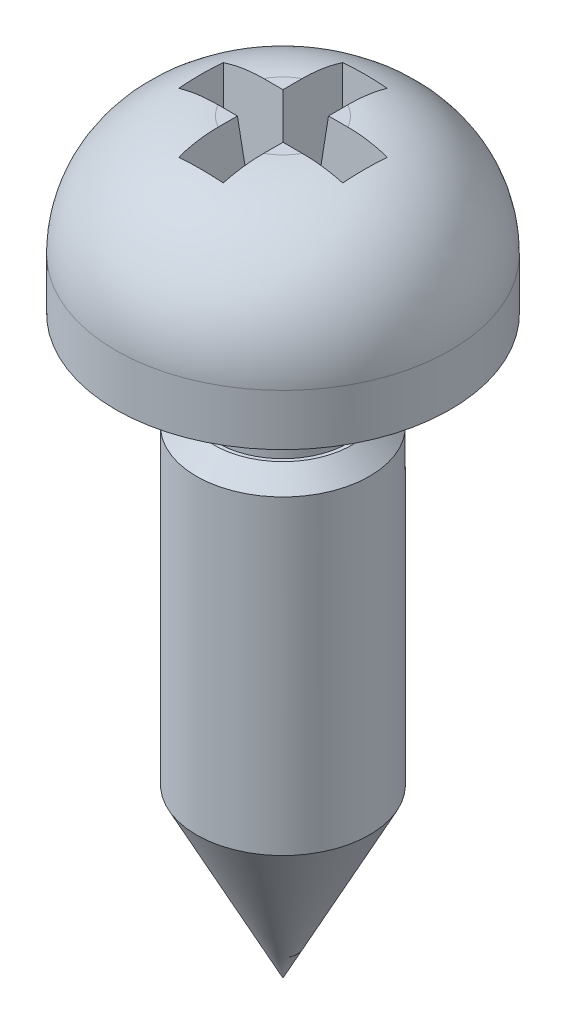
ISO-10303-21;
HEADER;
FILE_DESCRIPTION(('STEP AP214'),'2;1');
FILE_NAME('part.step','',(''),(''),'','','');
FILE_SCHEMA(('AUTOMOTIVE_DESIGN { 1 0 10303 214 1 1 1 1 }'));
ENDSEC;
DATA;
#1=APPLICATION_CONTEXT('core data for automotive mechanical design processes');
#2=APPLICATION_PROTOCOL_DEFINITION('international standard','automotive_design',2000,#1);
#3=PRODUCT_CONTEXT('',#1,'mechanical');
#4=PRODUCT('Part','Part','',(#3));
#5=PRODUCT_RELATED_PRODUCT_CATEGORY('part','',(#4));
#6=PRODUCT_DEFINITION_FORMATION('','',#4);
#7=PRODUCT_DEFINITION_CONTEXT('part definition',#1,'design');
#8=PRODUCT_DEFINITION('design','',#6,#7);
#9=PRODUCT_DEFINITION_SHAPE('','',#8);
#10=(LENGTH_UNIT() NAMED_UNIT(*) SI_UNIT(.MILLI.,.METRE.));
#11=(NAMED_UNIT(*) PLANE_ANGLE_UNIT() SI_UNIT($,.RADIAN.));
#12=(NAMED_UNIT(*) SI_UNIT($,.STERADIAN.) SOLID_ANGLE_UNIT());
#13=UNCERTAINTY_MEASURE_WITH_UNIT(LENGTH_MEASURE(1.E-05),#10,'distance_accuracy_value','');
#14=(GEOMETRIC_REPRESENTATION_CONTEXT(3) GLOBAL_UNCERTAINTY_ASSIGNED_CONTEXT((#13)) GLOBAL_UNIT_ASSIGNED_CONTEXT((#10,
#11,#12)) REPRESENTATION_CONTEXT('',''));
#15=CARTESIAN_POINT('',(0.,0.,0.));
#16=DIRECTION('',(0.,0.,1.));
#17=DIRECTION('',(1.,0.,0.));
#18=AXIS2_PLACEMENT_3D('',#15,#16,#17);
#19=CARTESIAN_POINT('',(0.,-3.44823964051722,0.));
#20=DIRECTION('',(0.,-1.,0.));
#21=DIRECTION('',(0.,0.,-1.));
#22=AXIS2_PLACEMENT_3D('',#19,#20,#21);
#23=PLANE('',#22);
#24=DIRECTION('',(-1.,0.,0.));
#25=VECTOR('',#24,1.);
#26=CARTESIAN_POINT('',(-0.25,-3.44823964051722,0.381232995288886));
#27=LINE('',#26,#25);
#28=CARTESIAN_POINT('',(-0.703321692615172,-3.44823964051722,0.381232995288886));
#29=VERTEX_POINT('',#28);
#30=CARTESIAN_POINT('',(-0.381232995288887,-3.44823964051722,0.381232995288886));
#31=VERTEX_POINT('',#30);
#32=EDGE_CURVE('E254',#29,#31,#27,.F.);
#33=ORIENTED_EDGE('',*,*,#32,.F.);
#34=CARTESIAN_POINT('',(0.,-3.44823964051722,0.));
#35=DIRECTION('',(0.,-1.,0.));
#36=DIRECTION('',(0.,0.,-1.));
#37=AXIS2_PLACEMENT_3D('',#34,#35,#36);
#38=CIRCLE('',#37,0.800000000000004);
#39=CARTESIAN_POINT('',(-0.381232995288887,-3.44823964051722,0.703321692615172));
#40=VERTEX_POINT('',#39);
#41=EDGE_CURVE('E267',#29,#40,#38,.F.);
#42=ORIENTED_EDGE('',*,*,#41,.T.);
#43=DIRECTION('',(0.,0.,-1.));
#44=VECTOR('',#43,1.);
#45=CARTESIAN_POINT('',(-0.381232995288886,-3.44823964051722,1.25));
#46=LINE('',#45,#44);
#47=EDGE_CURVE('E251',#31,#40,#46,.F.);
#48=ORIENTED_EDGE('',*,*,#47,.F.);
#49=EDGE_LOOP('',(#33,#42,#48));
#50=FACE_BOUND('',#49,.T.);
#51=ADVANCED_FACE('F31',(#50),#23,.F.);
#52=DIRECTION('',(0.,0.,1.));
#53=VECTOR('',#52,1.);
#54=CARTESIAN_POINT('',(0.381232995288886,-3.44823964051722,0.25));
#55=LINE('',#54,#53);
#56=CARTESIAN_POINT('',(0.381232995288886,-3.44823964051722,0.703321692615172));
#57=VERTEX_POINT('',#56);
#58=CARTESIAN_POINT('',(0.381232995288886,-3.44823964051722,0.381232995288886));
#59=VERTEX_POINT('',#58);
#60=EDGE_CURVE('E248',#57,#59,#55,.F.);
#61=ORIENTED_EDGE('',*,*,#60,.F.);
#62=CARTESIAN_POINT('',(0.,-3.44823964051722,0.));
#63=DIRECTION('',(0.,-1.,0.));
#64=DIRECTION('',(0.,0.,-1.));
#65=AXIS2_PLACEMENT_3D('',#62,#63,#64);
#66=CIRCLE('',#65,0.800000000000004);
#67=CARTESIAN_POINT('',(0.703321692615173,-3.44823964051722,0.381232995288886));
#68=VERTEX_POINT('',#67);
#69=EDGE_CURVE('E265',#57,#68,#66,.F.);
#70=ORIENTED_EDGE('',*,*,#69,.T.);
#71=DIRECTION('',(-1.,0.,0.));
#72=VECTOR('',#71,1.);
#73=CARTESIAN_POINT('',(1.25,-3.44823964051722,0.381232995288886));
#74=LINE('',#73,#72);
#75=EDGE_CURVE('E250',#59,#68,#74,.F.);
#76=ORIENTED_EDGE('',*,*,#75,.F.);
#77=EDGE_LOOP('',(#61,#70,#76));
#78=FACE_BOUND('',#77,.T.);
#79=ADVANCED_FACE('F412',(#78),#23,.F.);
#80=DIRECTION('',(1.,0.,0.));
#81=VECTOR('',#80,1.);
#82=CARTESIAN_POINT('',(0.249999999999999,-3.44823964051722,-0.381232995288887));
#83=LINE('',#82,#81);
#84=CARTESIAN_POINT('',(0.703321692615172,-3.44823964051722,-0.381232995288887));
#85=VERTEX_POINT('',#84);
#86=CARTESIAN_POINT('',(0.381232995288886,-3.44823964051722,-0.381232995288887));
#87=VERTEX_POINT('',#86);
#88=EDGE_CURVE('E175',#85,#87,#83,.F.);
#89=ORIENTED_EDGE('',*,*,#88,.F.);
#90=CARTESIAN_POINT('',(0.,-3.44823964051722,0.));
#91=DIRECTION('',(0.,-1.,0.));
#92=DIRECTION('',(0.,0.,-1.));
#93=AXIS2_PLACEMENT_3D('',#90,#91,#92);
#94=CIRCLE('',#93,0.800000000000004);
#95=CARTESIAN_POINT('',(0.381232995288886,-3.44823964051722,-0.703321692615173));
#96=VERTEX_POINT('',#95);
#97=EDGE_CURVE('E263',#85,#96,#94,.F.);
#98=ORIENTED_EDGE('',*,*,#97,.T.);
#99=DIRECTION('',(0.,0.,1.));
#100=VECTOR('',#99,1.);
#101=CARTESIAN_POINT('',(0.381232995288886,-3.44823964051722,-1.25));
#102=LINE('',#101,#100);
#103=EDGE_CURVE('E172',#87,#96,#102,.F.);
#104=ORIENTED_EDGE('',*,*,#103,.F.);
#105=EDGE_LOOP('',(#89,#98,#104));
#106=FACE_BOUND('',#105,.T.);
#107=ADVANCED_FACE('F377',(#106),#23,.F.);
#108=CARTESIAN_POINT('',(0.,-15.9482396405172,0.));
#109=DIRECTION('',(0.,1.,0.));
#110=DIRECTION('',(0.,0.,1.));
#111=AXIS2_PLACEMENT_3D('',#108,#109,#110);
#112=CONICAL_SURFACE('',#111,0.,0.477831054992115);
#113=CARTESIAN_POINT('',(0.,-13.1482396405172,0.));
#114=DIRECTION('',(0.,1.,0.));
#115=DIRECTION('',(0.,0.,1.));
#116=AXIS2_PLACEMENT_3D('',#113,#114,#115);
#117=CIRCLE('',#116,1.45000000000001);
#118=CARTESIAN_POINT('',(0.,-13.1482396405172,1.45000000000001));
#119=VERTEX_POINT('',#118);
#120=EDGE_CURVE('E210',#119,#119,#117,.T.);
#121=ORIENTED_EDGE('',*,*,#120,.F.);
#122=EDGE_LOOP('',(#121));
#123=FACE_BOUND('',#122,.T.);
#124=CARTESIAN_POINT('',(0.,-15.9482396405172,0.));
#125=VERTEX_POINT('',#124);
#126=VERTEX_LOOP('',#125);
#127=FACE_BOUND('',#126,.T.);
#128=ADVANCED_FACE('F373',(#123,#127),#112,.T.);
#129=CARTESIAN_POINT('',(0.,31.7451466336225,0.));
#130=DIRECTION('',(0.,1.,0.));
#131=DIRECTION('',(0.,0.,1.));
#132=AXIS2_PLACEMENT_3D('',#129,#130,#131);
#133=CYLINDRICAL_SURFACE('',#132,1.45000000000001);
#134=CARTESIAN_POINT('',(0.,-7.94823964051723,0.));
#135=DIRECTION('',(0.,-1.,0.));
#136=DIRECTION('',(0.,0.,-1.));
#137=AXIS2_PLACEMENT_3D('',#134,#135,#136);
#138=CIRCLE('',#137,1.45000000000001);
#139=CARTESIAN_POINT('',(0.,-7.94823964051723,-1.45000000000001));
#140=VERTEX_POINT('',#139);
#141=EDGE_CURVE('E216',#140,#140,#138,.T.);
#142=ORIENTED_EDGE('',*,*,#141,.T.);
#143=EDGE_LOOP('',(#142));
#144=FACE_BOUND('',#143,.T.);
#145=ORIENTED_EDGE('',*,*,#120,.T.);
#146=EDGE_LOOP('',(#145));
#147=FACE_BOUND('',#146,.T.);
#148=ADVANCED_FACE('F376',(#144,#147),#133,.T.);
#149=CARTESIAN_POINT('',(1.09,-7.64823964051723,0.));
#150=DIRECTION('',(0.,-1.,0.));
#151=DIRECTION('',(0.,0.,-1.));
#152=AXIS2_PLACEMENT_3D('',#149,#150,#151);
#153=PLANE('',#152);
#154=CARTESIAN_POINT('',(0.,-7.64823964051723,0.));
#155=DIRECTION('',(0.,-1.,0.));
#156=DIRECTION('',(0.,0.,-1.));
#157=AXIS2_PLACEMENT_3D('',#154,#155,#156);
#158=CIRCLE('',#157,1.15);
#159=CARTESIAN_POINT('',(0.,-7.64823964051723,-1.15));
#160=VERTEX_POINT('',#159);
#161=EDGE_CURVE('E213',#160,#160,#158,.F.);
#162=ORIENTED_EDGE('',*,*,#161,.T.);
#163=EDGE_LOOP('',(#162));
#164=FACE_BOUND('',#163,.T.);
#165=CARTESIAN_POINT('',(0.,-7.64823964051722,0.));
#166=DIRECTION('',(0.,1.,0.));
#167=DIRECTION('',(0.,0.,1.));
#168=AXIS2_PLACEMENT_3D('',#165,#166,#167);
#169=CIRCLE('',#168,1.09);
#170=CARTESIAN_POINT('',(0.,-7.64823964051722,1.09));
#171=VERTEX_POINT('',#170);
#172=EDGE_CURVE('E206',#171,#171,#169,.T.);
#173=ORIENTED_EDGE('',*,*,#172,.F.);
#174=EDGE_LOOP('',(#173));
#175=FACE_BOUND('',#174,.T.);
#176=ADVANCED_FACE('F381',(#164,#175),#153,.F.);
#177=CARTESIAN_POINT('',(0.,31.7451466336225,0.));
#178=DIRECTION('',(0.,1.,0.));
#179=DIRECTION('',(0.,0.,1.));
#180=AXIS2_PLACEMENT_3D('',#177,#178,#179);
#181=CYLINDRICAL_SURFACE('',#180,1.09);
#182=CARTESIAN_POINT('',(0.,-6.557547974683,0.));
#183=DIRECTION('',(0.,1.,0.));
#184=DIRECTION('',(0.,0.,1.));
#185=AXIS2_PLACEMENT_3D('',#182,#183,#184);
#186=CIRCLE('',#185,1.09);
#187=CARTESIAN_POINT('',(0.,-6.557547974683,1.09));
#188=VERTEX_POINT('',#187);
#189=EDGE_CURVE('E11',#188,#188,#186,.F.);
#190=ORIENTED_EDGE('',*,*,#189,.T.);
#191=EDGE_LOOP('',(#190));
#192=FACE_BOUND('',#191,.T.);
#193=ORIENTED_EDGE('',*,*,#172,.T.);
#194=EDGE_LOOP('',(#193));
#195=FACE_BOUND('',#194,.T.);
#196=ADVANCED_FACE('F385',(#192,#195),#181,.T.);
#197=CARTESIAN_POINT('',(1.09,-6.307547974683,0.));
#198=DIRECTION('',(0.,1.,0.));
#199=DIRECTION('',(0.,0.,1.));
#200=AXIS2_PLACEMENT_3D('',#197,#198,#199);
#201=PLANE('',#200);
#202=CARTESIAN_POINT('',(0.,-6.307547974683,0.));
#203=DIRECTION('',(0.,1.,0.));
#204=DIRECTION('',(0.,0.,1.));
#205=AXIS2_PLACEMENT_3D('',#202,#203,#204);
#206=CIRCLE('',#205,1.34);
#207=CARTESIAN_POINT('',(0.,-6.307547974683,1.34));
#208=VERTEX_POINT('',#207);
#209=EDGE_CURVE('E40',#208,#208,#206,.T.);
#210=ORIENTED_EDGE('',*,*,#209,.T.);
#211=EDGE_LOOP('',(#210));
#212=FACE_BOUND('',#211,.T.);
#213=CARTESIAN_POINT('',(0.,-6.307547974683,0.));
#214=DIRECTION('',(0.,1.,0.));
#215=DIRECTION('',(0.,0.,1.));
#216=AXIS2_PLACEMENT_3D('',#213,#214,#215);
#217=CIRCLE('',#216,2.8);
#218=CARTESIAN_POINT('',(0.,-6.307547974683,2.8));
#219=VERTEX_POINT('',#218);
#220=EDGE_CURVE('E203',#219,#219,#217,.T.);
#221=ORIENTED_EDGE('',*,*,#220,.F.);
#222=EDGE_LOOP('',(#221));
#223=FACE_BOUND('',#222,.T.);
#224=ADVANCED_FACE('F389',(#212,#223),#201,.F.);
#225=CARTESIAN_POINT('',(0.,31.7451466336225,0.));
#226=DIRECTION('',(0.,1.,0.));
#227=DIRECTION('',(0.,0.,1.));
#228=AXIS2_PLACEMENT_3D('',#225,#226,#227);
#229=CYLINDRICAL_SURFACE('',#228,2.8);
#230=CARTESIAN_POINT('',(0.,-5.44823964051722,0.));
#231=DIRECTION('',(0.,-1.,0.));
#232=DIRECTION('',(0.,0.,-1.));
#233=AXIS2_PLACEMENT_3D('',#230,#231,#232);
#234=CIRCLE('',#233,2.8);
#235=CARTESIAN_POINT('',(0.,-5.44823964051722,-2.8));
#236=VERTEX_POINT('',#235);
#237=EDGE_CURVE('E332',#236,#236,#234,.T.);
#238=ORIENTED_EDGE('',*,*,#237,.T.);
#239=EDGE_LOOP('',(#238));
#240=FACE_BOUND('',#239,.T.);
#241=ORIENTED_EDGE('',*,*,#220,.T.);
#242=EDGE_LOOP('',(#241));
#243=FACE_BOUND('',#242,.T.);
#244=ADVANCED_FACE('F393',(#240,#243),#229,.T.);
#245=DIRECTION('',(0.,0.,-1.));
#246=VECTOR('',#245,1.);
#247=CARTESIAN_POINT('',(-0.381232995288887,-3.44823964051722,-0.250000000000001));
#248=LINE('',#247,#246);
#249=CARTESIAN_POINT('',(-0.381232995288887,-3.44823964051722,-0.703321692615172));
#250=VERTEX_POINT('',#249);
#251=CARTESIAN_POINT('',(-0.381232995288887,-3.44823964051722,-0.381232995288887));
#252=VERTEX_POINT('',#251);
#253=EDGE_CURVE('E157',#250,#252,#248,.F.);
#254=ORIENTED_EDGE('',*,*,#253,.F.);
#255=CARTESIAN_POINT('',(0.,-3.44823964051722,0.));
#256=DIRECTION('',(0.,-1.,0.));
#257=DIRECTION('',(0.,0.,-1.));
#258=AXIS2_PLACEMENT_3D('',#255,#256,#257);
#259=CIRCLE('',#258,0.800000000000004);
#260=CARTESIAN_POINT('',(-0.703321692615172,-3.44823964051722,-0.381232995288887));
#261=VERTEX_POINT('',#260);
#262=EDGE_CURVE('E219',#250,#261,#259,.F.);
#263=ORIENTED_EDGE('',*,*,#262,.T.);
#264=DIRECTION('',(1.,0.,0.));
#265=VECTOR('',#264,1.);
#266=CARTESIAN_POINT('',(-1.25,-3.44823964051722,-0.381232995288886));
#267=LINE('',#266,#265);
#268=EDGE_CURVE('E256',#252,#261,#267,.F.);
#269=ORIENTED_EDGE('',*,*,#268,.F.);
#270=EDGE_LOOP('',(#254,#263,#269));
#271=FACE_BOUND('',#270,.T.);
#272=ADVANCED_FACE('F397',(#271),#23,.F.);
#273=CARTESIAN_POINT('',(0.,-7.64823964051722,0.));
#274=DIRECTION('',(0.,-1.,0.));
#275=DIRECTION('',(0.,0.,-1.));
#276=AXIS2_PLACEMENT_3D('',#273,#274,#275);
#277=CONICAL_SURFACE('',#276,1.15,0.785398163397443);
#278=ORIENTED_EDGE('',*,*,#141,.F.);
#279=EDGE_LOOP('',(#278));
#280=FACE_BOUND('',#279,.T.);
#281=ORIENTED_EDGE('',*,*,#161,.F.);
#282=EDGE_LOOP('',(#281));
#283=FACE_BOUND('',#282,.T.);
#284=ADVANCED_FACE('F302',(#280,#283),#277,.T.);
#285=CARTESIAN_POINT('',(-0.25,-4.94823964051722,-0.250000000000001));
#286=DIRECTION('',(0.996194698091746,0.0871557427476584,0.));
#287=DIRECTION('',(-0.0871557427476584,0.996194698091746,0.));
#288=AXIS2_PLACEMENT_3D('',#285,#286,#287);
#289=PLANE('',#288);
#290=DIRECTION('',(-0.0868265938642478,0.992432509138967,-0.0868265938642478));
#291=VECTOR('',#290,1.);
#292=CARTESIAN_POINT('',(-0.250000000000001,-4.94823964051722,-1.25));
#293=LINE('',#292,#291);
#294=CARTESIAN_POINT('',(-0.250000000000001,-4.94823964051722,-1.25));
#295=VERTEX_POINT('',#294);
#296=CARTESIAN_POINT('',(-0.372549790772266,-3.54748912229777,-1.37254979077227));
#297=VERTEX_POINT('',#296);
#298=EDGE_CURVE('E207',#295,#297,#293,.T.);
#299=ORIENTED_EDGE('',*,*,#298,.T.);
#300=CARTESIAN_POINT('',(-0.372549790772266,-3.54748912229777,-1.37254979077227));
#301=CARTESIAN_POINT('',(-0.374036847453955,-3.53049198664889,-1.31838121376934));
#302=CARTESIAN_POINT('',(-0.375329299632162,-3.51571919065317,-1.26351872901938));
#303=CARTESIAN_POINT('',(-0.3775219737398,-3.49065681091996,-1.15310878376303));
#304=CARTESIAN_POINT('',(-0.378424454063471,-3.48034141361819,-1.09756723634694));
#305=CARTESIAN_POINT('',(-0.37985118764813,-3.46403377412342,-0.985883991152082));
#306=CARTESIAN_POINT('',(-0.380375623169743,-3.45803944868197,-0.929742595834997));
#307=CARTESIAN_POINT('',(-0.381069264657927,-3.45011109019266,-0.816835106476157));
#308=CARTESIAN_POINT('',(-0.381236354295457,-3.44820124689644,-0.760067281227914));
#309=CARTESIAN_POINT('',(-0.381232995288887,-3.44823964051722,-0.703321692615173));
#310=B_SPLINE_CURVE_WITH_KNOTS('',3,(#300,#301,#302,#303,#304,#305,#306,#307,#308,#309),
.UNSPECIFIED.,.F.,.F.,(4,2,2,2,4),(0.,0.170316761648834,0.339633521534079,0.508868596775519,
0.679103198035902),.UNSPECIFIED.);
#311=EDGE_CURVE('E306',#297,#250,#310,.T.);
#312=ORIENTED_EDGE('',*,*,#311,.T.);
#313=ORIENTED_EDGE('',*,*,#253,.T.);
#314=DIRECTION('',(-0.0868265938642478,0.992432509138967,-0.0868265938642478));
#315=VECTOR('',#314,1.);
#316=CARTESIAN_POINT('',(-0.257538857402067,-4.86207010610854,-0.257538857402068));
#317=LINE('',#316,#315);
#318=CARTESIAN_POINT('',(-0.25,-4.94823964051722,-0.250000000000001));
#319=VERTEX_POINT('',#318);
#320=EDGE_CURVE('E149',#319,#252,#317,.T.);
#321=ORIENTED_EDGE('',*,*,#320,.F.);
#322=DIRECTION('',(0.,0.,1.));
#323=VECTOR('',#322,1.);
#324=CARTESIAN_POINT('',(-0.25,-4.94823964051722,-0.250000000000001));
#325=LINE('',#324,#323);
#326=EDGE_CURVE('E154',#295,#319,#325,.T.);
#327=ORIENTED_EDGE('',*,*,#326,.F.);
#328=EDGE_LOOP('',(#299,#312,#313,#321,#327));
#329=FACE_BOUND('',#328,.T.);
#330=ADVANCED_FACE('F152',(#329),#289,.T.);
#331=CARTESIAN_POINT('',(-0.250000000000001,-4.94823964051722,-1.25));
#332=DIRECTION('',(0.,0.0871557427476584,0.996194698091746));
#333=DIRECTION('',(0.,-0.996194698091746,0.0871557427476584));
#334=AXIS2_PLACEMENT_3D('',#331,#332,#333);
#335=PLANE('',#334);
#336=DIRECTION('',(0.0868265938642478,0.992432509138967,-0.0868265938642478));
#337=VECTOR('',#336,1.);
#338=CARTESIAN_POINT('',(0.249999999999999,-4.94823964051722,-1.25));
#339=LINE('',#338,#337);
#340=CARTESIAN_POINT('',(0.249999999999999,-4.94823964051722,-1.25));
#341=VERTEX_POINT('',#340);
#342=CARTESIAN_POINT('',(0.372549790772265,-3.54748912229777,-1.37254979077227));
#343=VERTEX_POINT('',#342);
#344=EDGE_CURVE('E237',#341,#343,#339,.T.);
#345=ORIENTED_EDGE('',*,*,#344,.T.);
#346=CARTESIAN_POINT('',(0.372549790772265,-3.54748912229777,-1.37254979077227));
#347=CARTESIAN_POINT('',(0.310547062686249,-3.54234343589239,-1.3729999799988));
#348=CARTESIAN_POINT('',(0.248438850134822,-3.5385543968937,-1.37333147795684));
#349=CARTESIAN_POINT('',(0.124220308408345,-3.53355534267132,-1.37376883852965));
#350=CARTESIAN_POINT('',(0.0621101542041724,-3.53234105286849,-1.37387507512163));
#351=CARTESIAN_POINT('',(-0.0621101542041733,-3.53234105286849,-1.37387507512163));
#352=CARTESIAN_POINT('',(-0.124220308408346,-3.53355534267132,-1.37376883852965));
#353=CARTESIAN_POINT('',(-0.248438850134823,-3.5385543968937,-1.37333147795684));
#354=CARTESIAN_POINT('',(-0.31054706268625,-3.54234343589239,-1.3729999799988));
#355=CARTESIAN_POINT('',(-0.372549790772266,-3.54748912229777,-1.37254979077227));
#356=B_SPLINE_CURVE_WITH_KNOTS('',3,(#346,#347,#348,#349,#350,#351,#352,#353,#354,#355),
.UNSPECIFIED.,.F.,.F.,(4,2,2,2,4),(0.,0.186625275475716,0.372940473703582,0.559255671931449,
0.745880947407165),.UNSPECIFIED.);
#357=EDGE_CURVE('E312',#343,#297,#356,.T.);
#358=ORIENTED_EDGE('',*,*,#357,.T.);
#359=ORIENTED_EDGE('',*,*,#298,.F.);
#360=DIRECTION('',(-1.,0.,0.));
#361=VECTOR('',#360,1.);
#362=CARTESIAN_POINT('',(-0.250000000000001,-4.94823964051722,-1.25));
#363=LINE('',#362,#361);
#364=EDGE_CURVE('E160',#341,#295,#363,.T.);
#365=ORIENTED_EDGE('',*,*,#364,.F.);
#366=EDGE_LOOP('',(#345,#358,#359,#365));
#367=FACE_BOUND('',#366,.T.);
#368=ADVANCED_FACE('F301',(#367),#335,.T.);
#369=CARTESIAN_POINT('',(0.249999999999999,-4.94823964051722,-1.25));
#370=DIRECTION('',(-0.996194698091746,0.0871557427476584,0.));
#371=DIRECTION('',(-0.0871557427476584,-0.996194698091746,0.));
#372=AXIS2_PLACEMENT_3D('',#369,#370,#371);
#373=PLANE('',#372);
#374=ORIENTED_EDGE('',*,*,#103,.T.);
#375=CARTESIAN_POINT('',(0.381232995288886,-3.44823964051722,-0.703321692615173));
#376=CARTESIAN_POINT('',(0.381236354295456,-3.44820124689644,-0.760067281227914));
#377=CARTESIAN_POINT('',(0.381069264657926,-3.45011109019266,-0.816835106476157));
#378=CARTESIAN_POINT('',(0.380375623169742,-3.45803944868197,-0.929742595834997));
#379=CARTESIAN_POINT('',(0.379851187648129,-3.46403377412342,-0.985883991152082));
#380=CARTESIAN_POINT('',(0.37842445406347,-3.48034141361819,-1.09756723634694));
#381=CARTESIAN_POINT('',(0.377521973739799,-3.49065681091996,-1.15310878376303));
#382=CARTESIAN_POINT('',(0.375329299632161,-3.51571919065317,-1.26351872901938));
#383=CARTESIAN_POINT('',(0.374036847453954,-3.53049198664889,-1.31838121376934));
#384=CARTESIAN_POINT('',(0.372549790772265,-3.54748912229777,-1.37254979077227));
#385=B_SPLINE_CURVE_WITH_KNOTS('',3,(#375,#376,#377,#378,#379,#380,#381,#382,#383,#384),
.UNSPECIFIED.,.F.,.F.,(4,2,2,2,4),(0.,0.170234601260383,0.339469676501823,0.508786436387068,
0.679103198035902),.UNSPECIFIED.);
#386=EDGE_CURVE('E435',#96,#343,#385,.T.);
#387=ORIENTED_EDGE('',*,*,#386,.T.);
#388=ORIENTED_EDGE('',*,*,#344,.F.);
#389=DIRECTION('',(0.,0.,-1.));
#390=VECTOR('',#389,1.);
#391=CARTESIAN_POINT('',(0.249999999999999,-4.94823964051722,-1.25));
#392=LINE('',#391,#390);
#393=CARTESIAN_POINT('',(0.249999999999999,-4.94823964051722,-0.250000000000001));
#394=VERTEX_POINT('',#393);
#395=EDGE_CURVE('E200',#394,#341,#392,.T.);
#396=ORIENTED_EDGE('',*,*,#395,.F.);
#397=DIRECTION('',(0.0868265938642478,0.992432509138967,-0.0868265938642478));
#398=VECTOR('',#397,1.);
#399=CARTESIAN_POINT('',(0.257538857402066,-4.86207010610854,-0.257538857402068));
#400=LINE('',#399,#398);
#401=EDGE_CURVE('E240',#394,#87,#400,.T.);
#402=ORIENTED_EDGE('',*,*,#401,.T.);
#403=EDGE_LOOP('',(#374,#387,#388,#396,#402));
#404=FACE_BOUND('',#403,.T.);
#405=ADVANCED_FACE('F295',(#404),#373,.T.);
#406=CARTESIAN_POINT('',(0.249999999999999,-4.94823964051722,-0.250000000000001));
#407=DIRECTION('',(0.,0.0871557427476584,0.996194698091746));
#408=DIRECTION('',(0.,-0.996194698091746,0.0871557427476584));
#409=AXIS2_PLACEMENT_3D('',#406,#407,#408);
#410=PLANE('',#409);
#411=DIRECTION('',(0.0868265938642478,0.992432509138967,-0.0868265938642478));
#412=VECTOR('',#411,1.);
#413=CARTESIAN_POINT('',(1.25,-4.94823964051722,-0.250000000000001));
#414=LINE('',#413,#412);
#415=CARTESIAN_POINT('',(1.25,-4.94823964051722,-0.250000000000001));
#416=VERTEX_POINT('',#415);
#417=CARTESIAN_POINT('',(1.37254979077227,-3.54748912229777,-0.372549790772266));
#418=VERTEX_POINT('',#417);
#419=EDGE_CURVE('E243',#416,#418,#414,.T.);
#420=ORIENTED_EDGE('',*,*,#419,.T.);
#421=CARTESIAN_POINT('',(1.37254979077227,-3.54748912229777,-0.372549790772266));
#422=CARTESIAN_POINT('',(1.31838121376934,-3.53049198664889,-0.374036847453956));
#423=CARTESIAN_POINT('',(1.26351872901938,-3.51571919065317,-0.375329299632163));
#424=CARTESIAN_POINT('',(1.15310878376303,-3.49065681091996,-0.3775219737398));
#425=CARTESIAN_POINT('',(1.09756723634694,-3.48034141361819,-0.378424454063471));
#426=CARTESIAN_POINT('',(0.985883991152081,-3.46403377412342,-0.379851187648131));
#427=CARTESIAN_POINT('',(0.929742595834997,-3.45803944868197,-0.380375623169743));
#428=CARTESIAN_POINT('',(0.816835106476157,-3.45011109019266,-0.381069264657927));
#429=CARTESIAN_POINT('',(0.760067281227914,-3.44820124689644,-0.381236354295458));
#430=CARTESIAN_POINT('',(0.703321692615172,-3.44823964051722,-0.381232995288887));
#431=B_SPLINE_CURVE_WITH_KNOTS('',3,(#421,#422,#423,#424,#425,#426,#427,#428,#429,#430),
.UNSPECIFIED.,.F.,.F.,(4,2,2,2,4),(0.,0.170316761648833,0.339633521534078,0.508868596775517,
0.6791031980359),.UNSPECIFIED.);
#432=EDGE_CURVE('E361',#418,#85,#431,.T.);
#433=ORIENTED_EDGE('',*,*,#432,.T.);
#434=ORIENTED_EDGE('',*,*,#88,.T.);
#435=ORIENTED_EDGE('',*,*,#401,.F.);
#436=DIRECTION('',(-1.,0.,0.));
#437=VECTOR('',#436,1.);
#438=CARTESIAN_POINT('',(0.249999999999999,-4.94823964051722,-0.250000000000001));
#439=LINE('',#438,#437);
#440=EDGE_CURVE('E197',#416,#394,#439,.T.);
#441=ORIENTED_EDGE('',*,*,#440,.F.);
#442=EDGE_LOOP('',(#420,#433,#434,#435,#441));
#443=FACE_BOUND('',#442,.T.);
#444=ADVANCED_FACE('F367',(#443),#410,.T.);
#445=CARTESIAN_POINT('',(1.25,-4.94823964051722,-0.250000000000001));
#446=DIRECTION('',(-0.996194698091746,0.0871557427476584,0.));
#447=DIRECTION('',(-0.0871557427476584,-0.996194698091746,0.));
#448=AXIS2_PLACEMENT_3D('',#445,#446,#447);
#449=PLANE('',#448);
#450=DIRECTION('',(0.0868265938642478,0.992432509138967,0.0868265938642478));
#451=VECTOR('',#450,1.);
#452=CARTESIAN_POINT('',(1.25,-4.94823964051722,0.249999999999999));
#453=LINE('',#452,#451);
#454=CARTESIAN_POINT('',(1.25,-4.94823964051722,0.249999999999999));
#455=VERTEX_POINT('',#454);
#456=CARTESIAN_POINT('',(1.37254979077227,-3.54748912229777,0.372549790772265));
#457=VERTEX_POINT('',#456);
#458=EDGE_CURVE('E223',#455,#457,#453,.T.);
#459=ORIENTED_EDGE('',*,*,#458,.T.);
#460=CARTESIAN_POINT('',(1.37254979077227,-3.54748912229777,0.372549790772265));
#461=CARTESIAN_POINT('',(1.3729999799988,-3.54234343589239,0.310547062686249));
#462=CARTESIAN_POINT('',(1.37333147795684,-3.5385543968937,0.248438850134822));
#463=CARTESIAN_POINT('',(1.37376883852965,-3.53355534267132,0.124220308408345));
#464=CARTESIAN_POINT('',(1.37387507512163,-3.53234105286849,0.0621101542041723));
#465=CARTESIAN_POINT('',(1.37387507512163,-3.53234105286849,-0.0621101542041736));
#466=CARTESIAN_POINT('',(1.37376883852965,-3.53355534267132,-0.124220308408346));
#467=CARTESIAN_POINT('',(1.37333147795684,-3.5385543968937,-0.248438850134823));
#468=CARTESIAN_POINT('',(1.3729999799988,-3.54234343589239,-0.310547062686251));
#469=CARTESIAN_POINT('',(1.37254979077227,-3.54748912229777,-0.372549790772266));
#470=B_SPLINE_CURVE_WITH_KNOTS('',3,(#460,#461,#462,#463,#464,#465,#466,#467,#468,#469),
.UNSPECIFIED.,.F.,.F.,(4,2,2,2,4),(0.,0.186625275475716,0.372940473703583,0.559255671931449,
0.745880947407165),.UNSPECIFIED.);
#471=EDGE_CURVE('E351',#457,#418,#470,.T.);
#472=ORIENTED_EDGE('',*,*,#471,.T.);
#473=ORIENTED_EDGE('',*,*,#419,.F.);
#474=DIRECTION('',(0.,0.,-1.));
#475=VECTOR('',#474,1.);
#476=CARTESIAN_POINT('',(1.25,-4.94823964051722,-0.250000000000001));
#477=LINE('',#476,#475);
#478=EDGE_CURVE('E194',#455,#416,#477,.T.);
#479=ORIENTED_EDGE('',*,*,#478,.F.);
#480=EDGE_LOOP('',(#459,#472,#473,#479));
#481=FACE_BOUND('',#480,.T.);
#482=ADVANCED_FACE('F342',(#481),#449,.T.);
#483=CARTESIAN_POINT('',(1.25,-4.94823964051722,0.249999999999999));
#484=DIRECTION('',(0.,0.0871557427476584,-0.996194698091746));
#485=DIRECTION('',(0.,0.996194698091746,0.0871557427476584));
#486=AXIS2_PLACEMENT_3D('',#483,#484,#485);
#487=PLANE('',#486);
#488=ORIENTED_EDGE('',*,*,#75,.T.);
#489=CARTESIAN_POINT('',(0.703321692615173,-3.44823964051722,0.381232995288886));
#490=CARTESIAN_POINT('',(0.760067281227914,-3.44820124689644,0.381236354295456));
#491=CARTESIAN_POINT('',(0.816835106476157,-3.45011109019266,0.381069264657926));
#492=CARTESIAN_POINT('',(0.929742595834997,-3.45803944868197,0.380375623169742));
#493=CARTESIAN_POINT('',(0.985883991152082,-3.46403377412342,0.37985118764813));
#494=CARTESIAN_POINT('',(1.09756723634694,-3.48034141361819,0.37842445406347));
#495=CARTESIAN_POINT('',(1.15310878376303,-3.49065681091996,0.377521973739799));
#496=CARTESIAN_POINT('',(1.26351872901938,-3.51571919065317,0.375329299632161));
#497=CARTESIAN_POINT('',(1.31838121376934,-3.53049198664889,0.374036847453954));
#498=CARTESIAN_POINT('',(1.37254979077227,-3.54748912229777,0.372549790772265));
#499=B_SPLINE_CURVE_WITH_KNOTS('',3,(#489,#490,#491,#492,#493,#494,#495,#496,#497,#498),
.UNSPECIFIED.,.F.,.F.,(4,2,2,2,4),(0.,0.170234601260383,0.339469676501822,0.508786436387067,
0.6791031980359),.UNSPECIFIED.);
#500=EDGE_CURVE('E346',#68,#457,#499,.T.);
#501=ORIENTED_EDGE('',*,*,#500,.T.);
#502=ORIENTED_EDGE('',*,*,#458,.F.);
#503=DIRECTION('',(1.,0.,0.));
#504=VECTOR('',#503,1.);
#505=CARTESIAN_POINT('',(1.25,-4.94823964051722,0.249999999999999));
#506=LINE('',#505,#504);
#507=CARTESIAN_POINT('',(0.25,-4.94823964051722,0.25));
#508=VERTEX_POINT('',#507);
#509=EDGE_CURVE('E191',#508,#455,#506,.T.);
#510=ORIENTED_EDGE('',*,*,#509,.F.);
#511=DIRECTION('',(0.0868265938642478,0.992432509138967,0.0868265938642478));
#512=VECTOR('',#511,1.);
#513=CARTESIAN_POINT('',(0.257538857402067,-4.86207010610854,0.257538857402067));
#514=LINE('',#513,#512);
#515=EDGE_CURVE('E220',#508,#59,#514,.T.);
#516=ORIENTED_EDGE('',*,*,#515,.T.);
#517=EDGE_LOOP('',(#488,#501,#502,#510,#516));
#518=FACE_BOUND('',#517,.T.);
#519=ADVANCED_FACE('F338',(#518),#487,.T.);
#520=CARTESIAN_POINT('',(0.25,-4.94823964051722,0.25));
#521=DIRECTION('',(-0.996194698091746,0.0871557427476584,0.));
#522=DIRECTION('',(-0.0871557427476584,-0.996194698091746,0.));
#523=AXIS2_PLACEMENT_3D('',#520,#521,#522);
#524=PLANE('',#523);
#525=DIRECTION('',(0.0868265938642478,0.992432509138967,0.0868265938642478));
#526=VECTOR('',#525,1.);
#527=CARTESIAN_POINT('',(0.25,-4.94823964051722,1.25));
#528=LINE('',#527,#526);
#529=CARTESIAN_POINT('',(0.25,-4.94823964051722,1.25));
#530=VERTEX_POINT('',#529);
#531=CARTESIAN_POINT('',(0.372549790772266,-3.54748912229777,1.37254979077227));
#532=VERTEX_POINT('',#531);
#533=EDGE_CURVE('E224',#530,#532,#528,.T.);
#534=ORIENTED_EDGE('',*,*,#533,.T.);
#535=CARTESIAN_POINT('',(0.372549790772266,-3.54748912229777,1.37254979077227));
#536=CARTESIAN_POINT('',(0.374036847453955,-3.53049198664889,1.31838121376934));
#537=CARTESIAN_POINT('',(0.375329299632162,-3.51571919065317,1.26351872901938));
#538=CARTESIAN_POINT('',(0.377521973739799,-3.49065681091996,1.15310878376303));
#539=CARTESIAN_POINT('',(0.37842445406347,-3.48034141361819,1.09756723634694));
#540=CARTESIAN_POINT('',(0.37985118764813,-3.46403377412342,0.985883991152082));
#541=CARTESIAN_POINT('',(0.380375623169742,-3.45803944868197,0.929742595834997));
#542=CARTESIAN_POINT('',(0.381069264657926,-3.45011109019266,0.816835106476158));
#543=CARTESIAN_POINT('',(0.381236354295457,-3.44820124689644,0.760067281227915));
#544=CARTESIAN_POINT('',(0.381232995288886,-3.44823964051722,0.703321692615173));
#545=B_SPLINE_CURVE_WITH_KNOTS('',3,(#535,#536,#537,#538,#539,#540,#541,#542,#543,#544),
.UNSPECIFIED.,.F.,.F.,(4,2,2,2,4),(0.,0.170316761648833,0.339633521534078,0.508868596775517,
0.6791031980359),.UNSPECIFIED.);
#546=EDGE_CURVE('E352',#532,#57,#545,.T.);
#547=ORIENTED_EDGE('',*,*,#546,.T.);
#548=ORIENTED_EDGE('',*,*,#60,.T.);
#549=ORIENTED_EDGE('',*,*,#515,.F.);
#550=DIRECTION('',(0.,0.,-1.));
#551=VECTOR('',#550,1.);
#552=CARTESIAN_POINT('',(0.25,-4.94823964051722,0.25));
#553=LINE('',#552,#551);
#554=EDGE_CURVE('E188',#530,#508,#553,.T.);
#555=ORIENTED_EDGE('',*,*,#554,.F.);
#556=EDGE_LOOP('',(#534,#547,#548,#549,#555));
#557=FACE_BOUND('',#556,.T.);
#558=ADVANCED_FACE('F341',(#557),#524,.T.);
#559=CARTESIAN_POINT('',(0.25,-4.94823964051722,1.25));
#560=DIRECTION('',(0.,0.0871557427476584,-0.996194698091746));
#561=DIRECTION('',(0.,0.996194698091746,0.0871557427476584));
#562=AXIS2_PLACEMENT_3D('',#559,#560,#561);
#563=PLANE('',#562);
#564=DIRECTION('',(-0.0868265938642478,0.992432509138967,0.0868265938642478));
#565=VECTOR('',#564,1.);
#566=CARTESIAN_POINT('',(-0.25,-4.94823964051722,1.25));
#567=LINE('',#566,#565);
#568=CARTESIAN_POINT('',(-0.25,-4.94823964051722,1.25));
#569=VERTEX_POINT('',#568);
#570=CARTESIAN_POINT('',(-0.372549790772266,-3.54748912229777,1.37254979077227));
#571=VERTEX_POINT('',#570);
#572=EDGE_CURVE('E227',#569,#571,#567,.T.);
#573=ORIENTED_EDGE('',*,*,#572,.T.);
#574=CARTESIAN_POINT('',(-0.372549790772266,-3.54748912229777,1.37254979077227));
#575=CARTESIAN_POINT('',(-0.31054706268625,-3.54234343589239,1.3729999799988));
#576=CARTESIAN_POINT('',(-0.248438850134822,-3.5385543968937,1.37333147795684));
#577=CARTESIAN_POINT('',(-0.124220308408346,-3.53355534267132,1.37376883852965));
#578=CARTESIAN_POINT('',(-0.0621101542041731,-3.53234105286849,1.37387507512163));
#579=CARTESIAN_POINT('',(0.0621101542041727,-3.53234105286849,1.37387507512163));
#580=CARTESIAN_POINT('',(0.124220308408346,-3.53355534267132,1.37376883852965));
#581=CARTESIAN_POINT('',(0.248438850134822,-3.5385543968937,1.37333147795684));
#582=CARTESIAN_POINT('',(0.31054706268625,-3.54234343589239,1.3729999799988));
#583=CARTESIAN_POINT('',(0.372549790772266,-3.54748912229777,1.37254979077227));
#584=B_SPLINE_CURVE_WITH_KNOTS('',3,(#574,#575,#576,#577,#578,#579,#580,#581,#582,#583),
.UNSPECIFIED.,.F.,.F.,(4,2,2,2,4),(0.,0.186625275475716,0.372940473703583,0.559255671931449,
0.745880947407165),.UNSPECIFIED.);
#585=EDGE_CURVE('E277',#571,#532,#584,.T.);
#586=ORIENTED_EDGE('',*,*,#585,.T.);
#587=ORIENTED_EDGE('',*,*,#533,.F.);
#588=DIRECTION('',(1.,0.,0.));
#589=VECTOR('',#588,1.);
#590=CARTESIAN_POINT('',(0.25,-4.94823964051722,1.25));
#591=LINE('',#590,#589);
#592=EDGE_CURVE('E185',#569,#530,#591,.T.);
#593=ORIENTED_EDGE('',*,*,#592,.F.);
#594=EDGE_LOOP('',(#573,#586,#587,#593));
#595=FACE_BOUND('',#594,.T.);
#596=ADVANCED_FACE('F293',(#595),#563,.T.);
#597=CARTESIAN_POINT('',(-0.25,-4.94823964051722,1.25));
#598=DIRECTION('',(0.996194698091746,0.0871557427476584,0.));
#599=DIRECTION('',(-0.0871557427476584,0.996194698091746,0.));
#600=AXIS2_PLACEMENT_3D('',#597,#598,#599);
#601=PLANE('',#600);
#602=ORIENTED_EDGE('',*,*,#47,.T.);
#603=CARTESIAN_POINT('',(-0.381232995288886,-3.44823964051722,0.703321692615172));
#604=CARTESIAN_POINT('',(-0.381236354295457,-3.44820124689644,0.760067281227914));
#605=CARTESIAN_POINT('',(-0.381069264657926,-3.45011109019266,0.816835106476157));
#606=CARTESIAN_POINT('',(-0.380375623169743,-3.45803944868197,0.929742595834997));
#607=CARTESIAN_POINT('',(-0.37985118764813,-3.46403377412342,0.985883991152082));
#608=CARTESIAN_POINT('',(-0.37842445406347,-3.48034141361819,1.09756723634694));
#609=CARTESIAN_POINT('',(-0.377521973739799,-3.49065681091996,1.15310878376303));
#610=CARTESIAN_POINT('',(-0.375329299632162,-3.51571919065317,1.26351872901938));
#611=CARTESIAN_POINT('',(-0.374036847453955,-3.53049198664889,1.31838121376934));
#612=CARTESIAN_POINT('',(-0.372549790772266,-3.54748912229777,1.37254979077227));
#613=B_SPLINE_CURVE_WITH_KNOTS('',3,(#603,#604,#605,#606,#607,#608,#609,#610,#611,#612),
.UNSPECIFIED.,.F.,.F.,(4,2,2,2,4),(0.,0.170234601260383,0.339469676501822,0.508786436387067,
0.679103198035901),.UNSPECIFIED.);
#614=EDGE_CURVE('E270',#40,#571,#613,.T.);
#615=ORIENTED_EDGE('',*,*,#614,.T.);
#616=ORIENTED_EDGE('',*,*,#572,.F.);
#617=DIRECTION('',(0.,0.,1.));
#618=VECTOR('',#617,1.);
#619=CARTESIAN_POINT('',(-0.25,-4.94823964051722,1.25));
#620=LINE('',#619,#618);
#621=CARTESIAN_POINT('',(-0.25,-4.94823964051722,0.25));
#622=VERTEX_POINT('',#621);
#623=EDGE_CURVE('E182',#622,#569,#620,.T.);
#624=ORIENTED_EDGE('',*,*,#623,.F.);
#625=DIRECTION('',(-0.0868265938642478,0.992432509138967,0.0868265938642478));
#626=VECTOR('',#625,1.);
#627=CARTESIAN_POINT('',(-0.257538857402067,-4.86207010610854,0.257538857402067));
#628=LINE('',#627,#626);
#629=EDGE_CURVE('E230',#622,#31,#628,.T.);
#630=ORIENTED_EDGE('',*,*,#629,.T.);
#631=EDGE_LOOP('',(#602,#615,#616,#624,#630));
#632=FACE_BOUND('',#631,.T.);
#633=ADVANCED_FACE('F287',(#632),#601,.T.);
#634=CARTESIAN_POINT('',(-0.25,-4.94823964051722,0.25));
#635=DIRECTION('',(0.,0.0871557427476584,-0.996194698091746));
#636=DIRECTION('',(0.,0.996194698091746,0.0871557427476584));
#637=AXIS2_PLACEMENT_3D('',#634,#635,#636);
#638=PLANE('',#637);
#639=DIRECTION('',(-0.0868265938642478,0.992432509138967,0.0868265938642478));
#640=VECTOR('',#639,1.);
#641=CARTESIAN_POINT('',(-1.25,-4.94823964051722,0.25));
#642=LINE('',#641,#640);
#643=CARTESIAN_POINT('',(-1.25,-4.94823964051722,0.25));
#644=VERTEX_POINT('',#643);
#645=CARTESIAN_POINT('',(-1.37254979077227,-3.54748912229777,0.372549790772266));
#646=VERTEX_POINT('',#645);
#647=EDGE_CURVE('E233',#644,#646,#642,.T.);
#648=ORIENTED_EDGE('',*,*,#647,.T.);
#649=CARTESIAN_POINT('',(-1.37254979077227,-3.54748912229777,0.372549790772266));
#650=CARTESIAN_POINT('',(-1.31838121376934,-3.53049198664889,0.374036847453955));
#651=CARTESIAN_POINT('',(-1.26351872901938,-3.51571919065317,0.375329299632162));
#652=CARTESIAN_POINT('',(-1.15310878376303,-3.49065681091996,0.377521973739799));
#653=CARTESIAN_POINT('',(-1.09756723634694,-3.48034141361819,0.37842445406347));
#654=CARTESIAN_POINT('',(-0.985883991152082,-3.46403377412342,0.37985118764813));
#655=CARTESIAN_POINT('',(-0.929742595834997,-3.45803944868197,0.380375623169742));
#656=CARTESIAN_POINT('',(-0.816835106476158,-3.45011109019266,0.381069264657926));
#657=CARTESIAN_POINT('',(-0.760067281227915,-3.44820124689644,0.381236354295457));
#658=CARTESIAN_POINT('',(-0.703321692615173,-3.44823964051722,0.381232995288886));
#659=B_SPLINE_CURVE_WITH_KNOTS('',3,(#649,#650,#651,#652,#653,#654,#655,#656,#657,#658),
.UNSPECIFIED.,.F.,.F.,(4,2,2,2,4),(0.,0.170316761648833,0.339633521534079,0.508868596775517,
0.679103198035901),.UNSPECIFIED.);
#660=EDGE_CURVE('E326',#646,#29,#659,.T.);
#661=ORIENTED_EDGE('',*,*,#660,.T.);
#662=ORIENTED_EDGE('',*,*,#32,.T.);
#663=ORIENTED_EDGE('',*,*,#629,.F.);
#664=DIRECTION('',(1.,0.,0.));
#665=VECTOR('',#664,1.);
#666=CARTESIAN_POINT('',(-0.25,-4.94823964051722,0.25));
#667=LINE('',#666,#665);
#668=EDGE_CURVE('E179',#644,#622,#667,.T.);
#669=ORIENTED_EDGE('',*,*,#668,.F.);
#670=EDGE_LOOP('',(#648,#661,#662,#663,#669));
#671=FACE_BOUND('',#670,.T.);
#672=ADVANCED_FACE('F292',(#671),#638,.T.);
#673=CARTESIAN_POINT('',(-1.25,-4.94823964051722,0.25));
#674=DIRECTION('',(0.996194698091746,0.0871557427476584,0.));
#675=DIRECTION('',(-0.0871557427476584,0.996194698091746,0.));
#676=AXIS2_PLACEMENT_3D('',#673,#674,#675);
#677=PLANE('',#676);
#678=DIRECTION('',(-0.0868265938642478,0.992432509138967,-0.0868265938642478));
#679=VECTOR('',#678,1.);
#680=CARTESIAN_POINT('',(-1.25,-4.94823964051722,-0.25));
#681=LINE('',#680,#679);
#682=CARTESIAN_POINT('',(-1.25,-4.94823964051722,-0.25));
#683=VERTEX_POINT('',#682);
#684=CARTESIAN_POINT('',(-1.37254979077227,-3.54748912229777,-0.372549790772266));
#685=VERTEX_POINT('',#684);
#686=EDGE_CURVE('E159',#683,#685,#681,.T.);
#687=ORIENTED_EDGE('',*,*,#686,.T.);
#688=CARTESIAN_POINT('',(-1.37254979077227,-3.54748912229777,-0.372549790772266));
#689=CARTESIAN_POINT('',(-1.3729999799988,-3.54234343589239,-0.31054706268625));
#690=CARTESIAN_POINT('',(-1.37333147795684,-3.5385543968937,-0.248438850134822));
#691=CARTESIAN_POINT('',(-1.37376883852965,-3.53355534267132,-0.124220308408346));
#692=CARTESIAN_POINT('',(-1.37387507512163,-3.53234105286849,-0.0621101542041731));
#693=CARTESIAN_POINT('',(-1.37387507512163,-3.53234105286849,0.0621101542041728));
#694=CARTESIAN_POINT('',(-1.37376883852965,-3.53355534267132,0.124220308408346));
#695=CARTESIAN_POINT('',(-1.37333147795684,-3.5385543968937,0.248438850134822));
#696=CARTESIAN_POINT('',(-1.3729999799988,-3.54234343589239,0.31054706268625));
#697=CARTESIAN_POINT('',(-1.37254979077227,-3.54748912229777,0.372549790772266));
#698=B_SPLINE_CURVE_WITH_KNOTS('',3,(#688,#689,#690,#691,#692,#693,#694,#695,#696,#697),
.UNSPECIFIED.,.F.,.F.,(4,2,2,2,4),(0.,0.186625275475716,0.372940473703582,0.559255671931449,
0.745880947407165),.UNSPECIFIED.);
#699=EDGE_CURVE('E47',#685,#646,#698,.T.);
#700=ORIENTED_EDGE('',*,*,#699,.T.);
#701=ORIENTED_EDGE('',*,*,#647,.F.);
#702=DIRECTION('',(0.,0.,1.));
#703=VECTOR('',#702,1.);
#704=CARTESIAN_POINT('',(-1.25,-4.94823964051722,0.25));
#705=LINE('',#704,#703);
#706=EDGE_CURVE('E167',#683,#644,#705,.T.);
#707=ORIENTED_EDGE('',*,*,#706,.F.);
#708=EDGE_LOOP('',(#687,#700,#701,#707));
#709=FACE_BOUND('',#708,.T.);
#710=ADVANCED_FACE('F303',(#709),#677,.T.);
#711=CARTESIAN_POINT('',(-1.25,-4.94823964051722,-0.25));
#712=DIRECTION('',(0.,0.0871557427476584,0.996194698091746));
#713=DIRECTION('',(0.,-0.996194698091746,0.0871557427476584));
#714=AXIS2_PLACEMENT_3D('',#711,#712,#713);
#715=PLANE('',#714);
#716=ORIENTED_EDGE('',*,*,#268,.T.);
#717=CARTESIAN_POINT('',(-0.703321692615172,-3.44823964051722,-0.381232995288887));
#718=CARTESIAN_POINT('',(-0.760067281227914,-3.44820124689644,-0.381236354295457));
#719=CARTESIAN_POINT('',(-0.816835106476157,-3.45011109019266,-0.381069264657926));
#720=CARTESIAN_POINT('',(-0.929742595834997,-3.45803944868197,-0.380375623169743));
#721=CARTESIAN_POINT('',(-0.985883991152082,-3.46403377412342,-0.37985118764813));
#722=CARTESIAN_POINT('',(-1.09756723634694,-3.48034141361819,-0.37842445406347));
#723=CARTESIAN_POINT('',(-1.15310878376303,-3.49065681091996,-0.377521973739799));
#724=CARTESIAN_POINT('',(-1.26351872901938,-3.51571919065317,-0.375329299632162));
#725=CARTESIAN_POINT('',(-1.31838121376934,-3.53049198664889,-0.374036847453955));
#726=CARTESIAN_POINT('',(-1.37254979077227,-3.54748912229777,-0.372549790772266));
#727=B_SPLINE_CURVE_WITH_KNOTS('',3,(#717,#718,#719,#720,#721,#722,#723,#724,#725,#726),
.UNSPECIFIED.,.F.,.F.,(4,2,2,2,4),(0.,0.170234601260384,0.339469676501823,0.508786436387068,
0.679103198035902),.UNSPECIFIED.);
#728=EDGE_CURVE('E55',#261,#685,#727,.T.);
#729=ORIENTED_EDGE('',*,*,#728,.T.);
#730=ORIENTED_EDGE('',*,*,#686,.F.);
#731=DIRECTION('',(-1.,0.,0.));
#732=VECTOR('',#731,1.);
#733=CARTESIAN_POINT('',(-1.25,-4.94823964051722,-0.25));
#734=LINE('',#733,#732);
#735=EDGE_CURVE('E163',#319,#683,#734,.T.);
#736=ORIENTED_EDGE('',*,*,#735,.F.);
#737=ORIENTED_EDGE('',*,*,#320,.T.);
#738=EDGE_LOOP('',(#716,#729,#730,#736,#737));
#739=FACE_BOUND('',#738,.T.);
#740=ADVANCED_FACE('F33',(#739),#715,.T.);
#741=CARTESIAN_POINT('',(-0.25,-4.94823964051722,0.25));
#742=DIRECTION('',(0.,1.,0.));
#743=DIRECTION('',(0.,0.,1.));
#744=AXIS2_PLACEMENT_3D('',#741,#742,#743);
#745=PLANE('',#744);
#746=ORIENTED_EDGE('',*,*,#326,.T.);
#747=ORIENTED_EDGE('',*,*,#735,.T.);
#748=ORIENTED_EDGE('',*,*,#706,.T.);
#749=ORIENTED_EDGE('',*,*,#668,.T.);
#750=ORIENTED_EDGE('',*,*,#623,.T.);
#751=ORIENTED_EDGE('',*,*,#592,.T.);
#752=ORIENTED_EDGE('',*,*,#554,.T.);
#753=ORIENTED_EDGE('',*,*,#509,.T.);
#754=ORIENTED_EDGE('',*,*,#478,.T.);
#755=ORIENTED_EDGE('',*,*,#440,.T.);
#756=ORIENTED_EDGE('',*,*,#395,.T.);
#757=ORIENTED_EDGE('',*,*,#364,.T.);
#758=EDGE_LOOP('',(#746,#747,#748,#749,#750,#751,#752,#753,#754,#755,#756,#757));
#759=FACE_BOUND('',#758,.T.);
#760=ADVANCED_FACE('F169',(#759),#745,.T.);
#761=CARTESIAN_POINT('',(0.,-5.44823964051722,0.));
#762=DIRECTION('',(0.,-1.,0.));
#763=DIRECTION('',(0.,0.,-1.));
#764=AXIS2_PLACEMENT_3D('',#761,#762,#763);
#765=DEGENERATE_TOROIDAL_SURFACE('',#764,0.800000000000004,2.,.T.);
#766=ORIENTED_EDGE('',*,*,#237,.F.);
#767=EDGE_LOOP('',(#766));
#768=FACE_BOUND('',#767,.T.);
#769=ORIENTED_EDGE('',*,*,#614,.F.);
#770=ORIENTED_EDGE('',*,*,#41,.F.);
#771=ORIENTED_EDGE('',*,*,#660,.F.);
#772=ORIENTED_EDGE('',*,*,#699,.F.);
#773=ORIENTED_EDGE('',*,*,#728,.F.);
#774=ORIENTED_EDGE('',*,*,#262,.F.);
#775=ORIENTED_EDGE('',*,*,#311,.F.);
#776=ORIENTED_EDGE('',*,*,#357,.F.);
#777=ORIENTED_EDGE('',*,*,#386,.F.);
#778=ORIENTED_EDGE('',*,*,#97,.F.);
#779=ORIENTED_EDGE('',*,*,#432,.F.);
#780=ORIENTED_EDGE('',*,*,#471,.F.);
#781=ORIENTED_EDGE('',*,*,#500,.F.);
#782=ORIENTED_EDGE('',*,*,#69,.F.);
#783=ORIENTED_EDGE('',*,*,#546,.F.);
#784=ORIENTED_EDGE('',*,*,#585,.F.);
#785=EDGE_LOOP('',(#769,#770,#771,#772,#773,#774,#775,#776,#777,#778,#779,#780,#781,#782,#783,#784));
#786=FACE_BOUND('',#785,.T.);
#787=ADVANCED_FACE('F283',(#768,#786),#765,.T.);
#788=CARTESIAN_POINT('',(0.,-6.307547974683,0.));
#789=DIRECTION('',(0.,1.,0.));
#790=DIRECTION('',(0.,0.,1.));
#791=AXIS2_PLACEMENT_3D('',#788,#789,#790);
#792=CONICAL_SURFACE('',#791,1.34,0.785398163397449);
#793=ORIENTED_EDGE('',*,*,#189,.F.);
#794=EDGE_LOOP('',(#793));
#795=FACE_BOUND('',#794,.T.);
#796=ORIENTED_EDGE('',*,*,#209,.F.);
#797=EDGE_LOOP('',(#796));
#798=FACE_BOUND('',#797,.T.);
#799=ADVANCED_FACE('F409',(#795,#798),#792,.T.);
#800=CLOSED_SHELL('',(#51,#79,#107,#128,#148,#176,#196,#224,#244,#272,#284,#330,#368,#405,#444,
#482,#519,#558,#596,#633,#672,#710,#740,#760,#787,#799));
#801=MANIFOLD_SOLID_BREP('B2',#800);
#802=ADVANCED_BREP_SHAPE_REPRESENTATION('',(#18,#801),#14);
#803=SHAPE_DEFINITION_REPRESENTATION(#9,#802);
ENDSEC;
END-ISO-10303-21;
